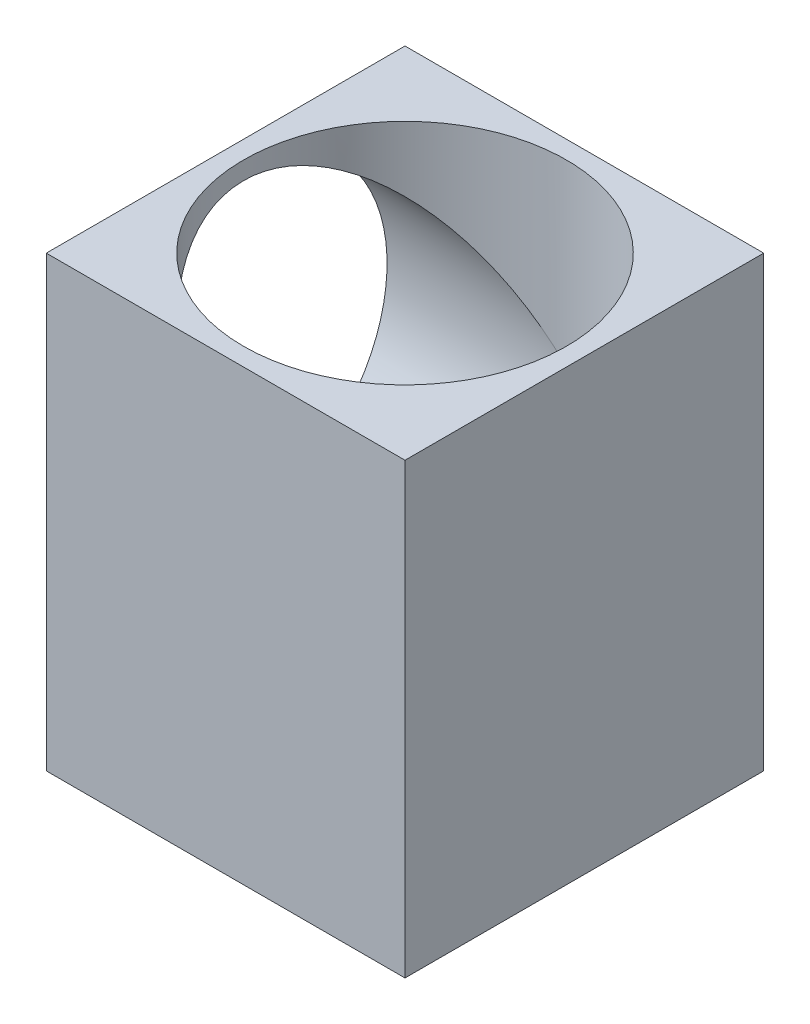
from build123d import *

# Parameters (mm, degrees)
SKETCH1_W               = 10
SKETCH1_H               = 10
BOSS_EXTRUDE1_DEPTH     = 12.5
SKETCH2_R               = 4.5
CUT_EXTRUDE1_DEPTH      = 10
SKETCH3_R               = 4.5
CUT_EXTRUDE2_DEPTH      = 5
F_1_4_20_TAPPED_HOLE1_D = 5.1054


with BuildPart() as part:
    # Sketch1 → Boss-Extrude1 (new body)
    with BuildSketch(Plane(origin=(0, 0, 0), x_dir=(1, 0, 0), z_dir=(0, 1, 0))):
        Rectangle(SKETCH1_W, SKETCH1_H)
    extrude(amount=BOSS_EXTRUDE1_DEPTH)

    # Sketch2 → Cut-Extrude1 (cut)
    with BuildSketch(Plane(origin=(0, 12.5, 0), x_dir=(1, 0, 0), z_dir=(0, 1, 0))):
        with Locations(Location((0, 0, 0), (0, 0, 270))):
            Circle(SKETCH2_R)
    extrude(amount=-CUT_EXTRUDE1_DEPTH, mode=Mode.SUBTRACT)

    # Sketch3 → Cut-Extrude2 (cut)
    with BuildSketch(Plane.ZY.offset(5)):
        with Locations((0, 7.5)):
            Circle(SKETCH3_R)
    extrude(amount=-CUT_EXTRUDE2_DEPTH, mode=Mode.SUBTRACT)

    # 1_4-20 Tapped Hole1 (through all)
    with Locations(Plane(origin=(0, 0, 0), x_dir=(-1, 0, 0), z_dir=(0, -1, 0))):
        with Locations((0, 0)):
            Hole(F_1_4_20_TAPPED_HOLE1_D / 2)


solid = part.part
